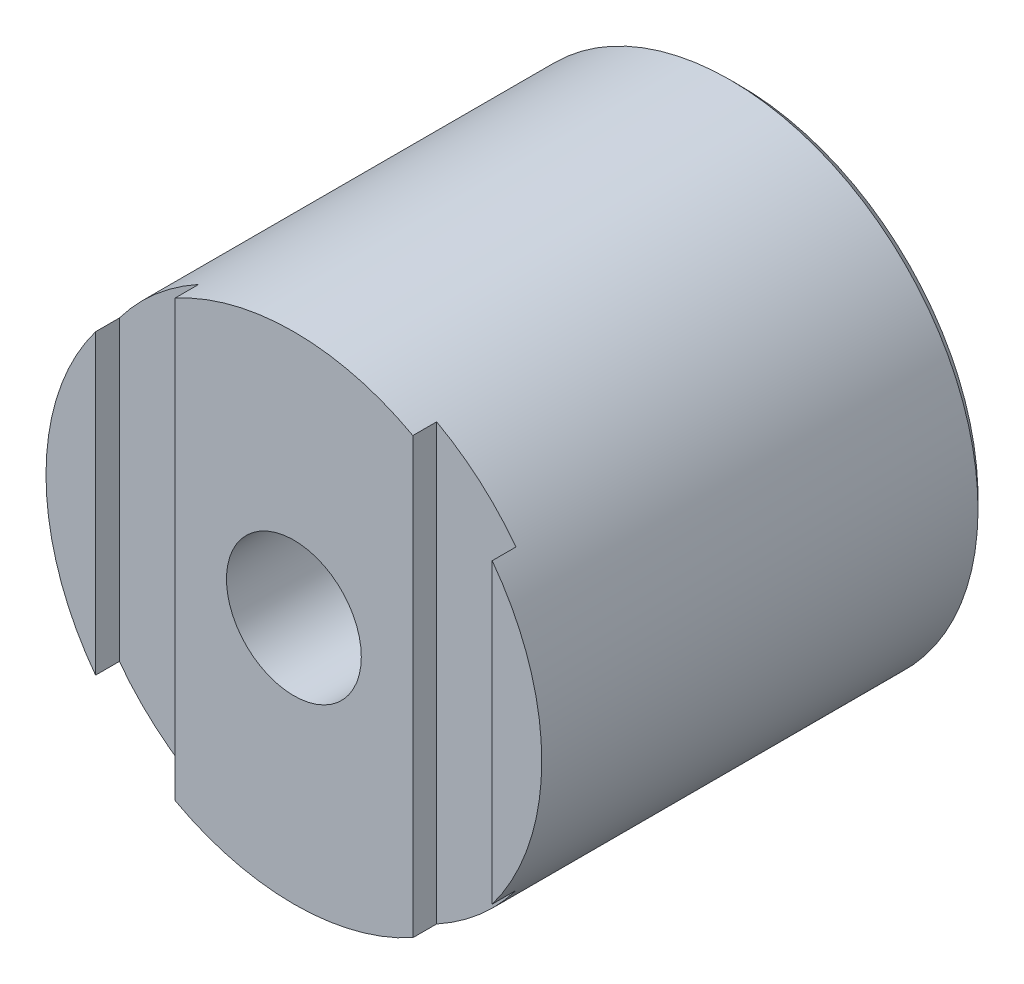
ISO-10303-21;
HEADER;
FILE_DESCRIPTION(('STEP AP214'),'2;1');
FILE_NAME('part.step','',(''),(''),'','','');
FILE_SCHEMA(('AUTOMOTIVE_DESIGN { 1 0 10303 214 1 1 1 1 }'));
ENDSEC;
DATA;
#1=APPLICATION_CONTEXT('core data for automotive mechanical design processes');
#2=APPLICATION_PROTOCOL_DEFINITION('international standard','automotive_design',2000,#1);
#3=PRODUCT_CONTEXT('',#1,'mechanical');
#4=PRODUCT('Part','Part','',(#3));
#5=PRODUCT_RELATED_PRODUCT_CATEGORY('part','',(#4));
#6=PRODUCT_DEFINITION_FORMATION('','',#4);
#7=PRODUCT_DEFINITION_CONTEXT('part definition',#1,'design');
#8=PRODUCT_DEFINITION('design','',#6,#7);
#9=PRODUCT_DEFINITION_SHAPE('','',#8);
#10=(LENGTH_UNIT() NAMED_UNIT(*) SI_UNIT(.MILLI.,.METRE.));
#11=(NAMED_UNIT(*) PLANE_ANGLE_UNIT() SI_UNIT($,.RADIAN.));
#12=(NAMED_UNIT(*) SI_UNIT($,.STERADIAN.) SOLID_ANGLE_UNIT());
#13=UNCERTAINTY_MEASURE_WITH_UNIT(LENGTH_MEASURE(1.E-05),#10,'distance_accuracy_value','');
#14=(GEOMETRIC_REPRESENTATION_CONTEXT(3) GLOBAL_UNCERTAINTY_ASSIGNED_CONTEXT((#13)) GLOBAL_UNIT_ASSIGNED_CONTEXT((#10,
#11,#12)) REPRESENTATION_CONTEXT('',''));
#15=CARTESIAN_POINT('',(0.,0.,0.));
#16=DIRECTION('',(0.,0.,1.));
#17=DIRECTION('',(1.,0.,0.));
#18=AXIS2_PLACEMENT_3D('',#15,#16,#17);
#19=CARTESIAN_POINT('',(0.,0.,0.));
#20=DIRECTION('',(0.,0.,1.));
#21=DIRECTION('',(1.,0.,0.));
#22=AXIS2_PLACEMENT_3D('',#19,#20,#21);
#23=PLANE('',#22);
#24=DIRECTION('',(0.,1.,0.));
#25=VECTOR('',#24,1.);
#26=CARTESIAN_POINT('',(10.,7.5,0.));
#27=LINE('',#26,#25);
#28=CARTESIAN_POINT('',(10.,-7.5,0.));
#29=VERTEX_POINT('',#28);
#30=CARTESIAN_POINT('',(10.,7.5,0.));
#31=VERTEX_POINT('',#30);
#32=EDGE_CURVE('E116',#29,#31,#27,.T.);
#33=ORIENTED_EDGE('',*,*,#32,.F.);
#34=CARTESIAN_POINT('',(0.,0.,0.));
#35=DIRECTION('',(0.,0.,1.));
#36=DIRECTION('',(1.,0.,0.));
#37=AXIS2_PLACEMENT_3D('',#34,#35,#36);
#38=CIRCLE('',#37,12.5);
#39=EDGE_CURVE('E123',#29,#31,#38,.T.);
#40=ORIENTED_EDGE('',*,*,#39,.T.);
#41=EDGE_LOOP('',(#33,#40));
#42=FACE_BOUND('',#41,.T.);
#43=ADVANCED_FACE('F31',(#42),#23,.T.);
#44=CARTESIAN_POINT('',(0.,0.,0.));
#45=DIRECTION('',(0.,0.,1.));
#46=DIRECTION('',(1.,0.,0.));
#47=AXIS2_PLACEMENT_3D('',#44,#45,#46);
#48=CIRCLE('',#47,3.39999999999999);
#49=CARTESIAN_POINT('',(3.39999999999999,0.,0.));
#50=VERTEX_POINT('',#49);
#51=EDGE_CURVE('E139',#50,#50,#48,.T.);
#52=ORIENTED_EDGE('',*,*,#51,.F.);
#53=EDGE_LOOP('',(#52));
#54=FACE_BOUND('',#53,.T.);
#55=DIRECTION('',(0.,-1.,0.));
#56=VECTOR('',#55,1.);
#57=CARTESIAN_POINT('',(6.,10.9658560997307,0.));
#58=LINE('',#57,#56);
#59=CARTESIAN_POINT('',(6.,10.9658560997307,0.));
#60=VERTEX_POINT('',#59);
#61=CARTESIAN_POINT('',(6.,-10.9658560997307,0.));
#62=VERTEX_POINT('',#61);
#63=EDGE_CURVE('E99',#60,#62,#58,.T.);
#64=ORIENTED_EDGE('',*,*,#63,.F.);
#65=CARTESIAN_POINT('',(-6.,10.9658560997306,0.));
#66=VERTEX_POINT('',#65);
#67=EDGE_CURVE('E112',#60,#66,#38,.T.);
#68=ORIENTED_EDGE('',*,*,#67,.T.);
#69=DIRECTION('',(0.,1.,0.));
#70=VECTOR('',#69,1.);
#71=CARTESIAN_POINT('',(-6.,10.9658560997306,0.));
#72=LINE('',#71,#70);
#73=CARTESIAN_POINT('',(-6.,-10.9658560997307,0.));
#74=VERTEX_POINT('',#73);
#75=EDGE_CURVE('E162',#74,#66,#72,.T.);
#76=ORIENTED_EDGE('',*,*,#75,.F.);
#77=EDGE_CURVE('E115',#74,#62,#38,.T.);
#78=ORIENTED_EDGE('',*,*,#77,.T.);
#79=EDGE_LOOP('',(#64,#68,#76,#78));
#80=FACE_BOUND('',#79,.T.);
#81=ADVANCED_FACE('F110',(#54,#80),#23,.T.);
#82=CARTESIAN_POINT('',(0.,0.,-22.5));
#83=DIRECTION('',(0.,0.,-1.));
#84=DIRECTION('',(-1.,0.,0.));
#85=AXIS2_PLACEMENT_3D('',#82,#83,#84);
#86=PLANE('',#85);
#87=CARTESIAN_POINT('',(0.,0.,-22.5));
#88=DIRECTION('',(0.,0.,-1.));
#89=DIRECTION('',(-1.,0.,0.));
#90=AXIS2_PLACEMENT_3D('',#87,#88,#89);
#91=CIRCLE('',#90,12.);
#92=CARTESIAN_POINT('',(-12.,0.,-22.5));
#93=VERTEX_POINT('',#92);
#94=EDGE_CURVE('E11',#93,#93,#91,.T.);
#95=ORIENTED_EDGE('',*,*,#94,.T.);
#96=EDGE_LOOP('',(#95));
#97=FACE_BOUND('',#96,.T.);
#98=CARTESIAN_POINT('',(0.,0.,-22.5));
#99=DIRECTION('',(0.,0.,1.));
#100=DIRECTION('',(1.,0.,0.));
#101=AXIS2_PLACEMENT_3D('',#98,#99,#100);
#102=CIRCLE('',#101,7.25);
#103=CARTESIAN_POINT('',(7.25,0.,-22.5));
#104=VERTEX_POINT('',#103);
#105=EDGE_CURVE('E176',#104,#104,#102,.T.);
#106=ORIENTED_EDGE('',*,*,#105,.T.);
#107=EDGE_LOOP('',(#106));
#108=FACE_BOUND('',#107,.T.);
#109=ADVANCED_FACE('F33',(#97,#108),#86,.T.);
#110=CARTESIAN_POINT('',(0.,0.,0.));
#111=DIRECTION('',(0.,0.,1.));
#112=DIRECTION('',(1.,0.,0.));
#113=AXIS2_PLACEMENT_3D('',#110,#111,#112);
#114=CYLINDRICAL_SURFACE('',#113,12.5);
#115=CARTESIAN_POINT('',(0.,0.,-22.));
#116=DIRECTION('',(0.,0.,-1.));
#117=DIRECTION('',(-1.,0.,0.));
#118=AXIS2_PLACEMENT_3D('',#115,#116,#117);
#119=CIRCLE('',#118,12.5);
#120=CARTESIAN_POINT('',(-12.5,0.,-22.));
#121=VERTEX_POINT('',#120);
#122=EDGE_CURVE('E39',#121,#121,#119,.F.);
#123=ORIENTED_EDGE('',*,*,#122,.T.);
#124=EDGE_LOOP('',(#123));
#125=FACE_BOUND('',#124,.T.);
#126=DIRECTION('',(0.,0.,1.));
#127=VECTOR('',#126,1.);
#128=CARTESIAN_POINT('',(6.,-10.9658560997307,-1.2));
#129=LINE('',#128,#127);
#130=CARTESIAN_POINT('',(6.,-10.9658560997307,-1.2));
#131=VERTEX_POINT('',#130);
#132=EDGE_CURVE('E106',#131,#62,#129,.T.);
#133=ORIENTED_EDGE('',*,*,#132,.T.);
#134=ORIENTED_EDGE('',*,*,#77,.F.);
#135=DIRECTION('',(0.,0.,1.));
#136=VECTOR('',#135,1.);
#137=CARTESIAN_POINT('',(-6.,-10.9658560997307,-1.2));
#138=LINE('',#137,#136);
#139=CARTESIAN_POINT('',(-6.,-10.9658560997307,-1.2));
#140=VERTEX_POINT('',#139);
#141=EDGE_CURVE('E177',#140,#74,#138,.T.);
#142=ORIENTED_EDGE('',*,*,#141,.F.);
#143=CARTESIAN_POINT('',(0.,0.,-1.2));
#144=DIRECTION('',(0.,0.,1.));
#145=DIRECTION('',(-1.,0.,0.));
#146=AXIS2_PLACEMENT_3D('',#143,#144,#145);
#147=CIRCLE('',#146,12.5);
#148=CARTESIAN_POINT('',(-10.,-7.49999999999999,-1.2));
#149=VERTEX_POINT('',#148);
#150=EDGE_CURVE('E170',#149,#140,#147,.T.);
#151=ORIENTED_EDGE('',*,*,#150,.F.);
#152=DIRECTION('',(0.,0.,1.));
#153=VECTOR('',#152,1.);
#154=CARTESIAN_POINT('',(-10.,-7.49999999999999,-1.2));
#155=LINE('',#154,#153);
#156=CARTESIAN_POINT('',(-10.,-7.49999999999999,0.));
#157=VERTEX_POINT('',#156);
#158=EDGE_CURVE('E179',#149,#157,#155,.T.);
#159=ORIENTED_EDGE('',*,*,#158,.T.);
#160=CARTESIAN_POINT('',(-10.,7.5,0.));
#161=VERTEX_POINT('',#160);
#162=EDGE_CURVE('E127',#161,#157,#38,.T.);
#163=ORIENTED_EDGE('',*,*,#162,.F.);
#164=DIRECTION('',(0.,0.,1.));
#165=VECTOR('',#164,1.);
#166=CARTESIAN_POINT('',(-10.,7.49999999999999,-1.2));
#167=LINE('',#166,#165);
#168=CARTESIAN_POINT('',(-10.,7.49999999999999,-1.2));
#169=VERTEX_POINT('',#168);
#170=EDGE_CURVE('E54',#169,#161,#167,.T.);
#171=ORIENTED_EDGE('',*,*,#170,.F.);
#172=CARTESIAN_POINT('',(0.,0.,-1.2));
#173=DIRECTION('',(0.,0.,1.));
#174=DIRECTION('',(-1.,0.,0.));
#175=AXIS2_PLACEMENT_3D('',#172,#173,#174);
#176=CIRCLE('',#175,12.5);
#177=CARTESIAN_POINT('',(-6.,10.9658560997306,-1.2));
#178=VERTEX_POINT('',#177);
#179=EDGE_CURVE('E164',#178,#169,#176,.T.);
#180=ORIENTED_EDGE('',*,*,#179,.F.);
#181=DIRECTION('',(0.,0.,1.));
#182=VECTOR('',#181,1.);
#183=CARTESIAN_POINT('',(-6.,10.9658560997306,-1.2));
#184=LINE('',#183,#182);
#185=EDGE_CURVE('E122',#178,#66,#184,.T.);
#186=ORIENTED_EDGE('',*,*,#185,.T.);
#187=ORIENTED_EDGE('',*,*,#67,.F.);
#188=DIRECTION('',(0.,0.,1.));
#189=VECTOR('',#188,1.);
#190=CARTESIAN_POINT('',(6.,10.9658560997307,-1.2));
#191=LINE('',#190,#189);
#192=CARTESIAN_POINT('',(6.,10.9658560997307,-1.2));
#193=VERTEX_POINT('',#192);
#194=EDGE_CURVE('E96',#193,#60,#191,.T.);
#195=ORIENTED_EDGE('',*,*,#194,.F.);
#196=CARTESIAN_POINT('',(0.,0.,-1.2));
#197=DIRECTION('',(0.,0.,1.));
#198=DIRECTION('',(1.,0.,0.));
#199=AXIS2_PLACEMENT_3D('',#196,#197,#198);
#200=CIRCLE('',#199,12.5);
#201=CARTESIAN_POINT('',(10.,7.5,-1.2));
#202=VERTEX_POINT('',#201);
#203=EDGE_CURVE('E148',#202,#193,#200,.T.);
#204=ORIENTED_EDGE('',*,*,#203,.F.);
#205=DIRECTION('',(0.,0.,1.));
#206=VECTOR('',#205,1.);
#207=CARTESIAN_POINT('',(10.,7.5,-1.2));
#208=LINE('',#207,#206);
#209=EDGE_CURVE('E154',#202,#31,#208,.T.);
#210=ORIENTED_EDGE('',*,*,#209,.T.);
#211=ORIENTED_EDGE('',*,*,#39,.F.);
#212=DIRECTION('',(0.,0.,1.));
#213=VECTOR('',#212,1.);
#214=CARTESIAN_POINT('',(10.,-7.5,-1.2));
#215=LINE('',#214,#213);
#216=CARTESIAN_POINT('',(10.,-7.5,-1.2));
#217=VERTEX_POINT('',#216);
#218=EDGE_CURVE('E158',#217,#29,#215,.T.);
#219=ORIENTED_EDGE('',*,*,#218,.F.);
#220=CARTESIAN_POINT('',(0.,0.,-1.2));
#221=DIRECTION('',(0.,0.,1.));
#222=DIRECTION('',(1.,0.,0.));
#223=AXIS2_PLACEMENT_3D('',#220,#221,#222);
#224=CIRCLE('',#223,12.5);
#225=EDGE_CURVE('E151',#131,#217,#224,.T.);
#226=ORIENTED_EDGE('',*,*,#225,.F.);
#227=EDGE_LOOP('',(#133,#134,#142,#151,#159,#163,#171,#180,#186,#187,#195,#204,#210,#211,#219,#226));
#228=FACE_BOUND('',#227,.T.);
#229=ADVANCED_FACE('F120',(#125,#228),#114,.T.);
#230=DIRECTION('',(0.,-1.,0.));
#231=VECTOR('',#230,1.);
#232=CARTESIAN_POINT('',(-10.,7.49999999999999,0.));
#233=LINE('',#232,#231);
#234=EDGE_CURVE('E157',#161,#157,#233,.T.);
#235=ORIENTED_EDGE('',*,*,#234,.F.);
#236=ORIENTED_EDGE('',*,*,#162,.T.);
#237=EDGE_LOOP('',(#235,#236));
#238=FACE_BOUND('',#237,.T.);
#239=ADVANCED_FACE('F213',(#238),#23,.T.);
#240=CARTESIAN_POINT('',(0.,0.,-16.));
#241=DIRECTION('',(0.,0.,1.));
#242=DIRECTION('',(-1.,0.,0.));
#243=AXIS2_PLACEMENT_3D('',#240,#241,#242);
#244=SPHERICAL_SURFACE('',#243,6.5);
#245=CARTESIAN_POINT('',(0.,0.,-10.4601444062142));
#246=DIRECTION('',(0.,0.,-1.));
#247=DIRECTION('',(-1.,0.,0.));
#248=AXIS2_PLACEMENT_3D('',#245,#246,#247);
#249=CIRCLE('',#248,3.39999999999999);
#250=CARTESIAN_POINT('',(-3.39999999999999,0.,-10.4601444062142));
#251=VERTEX_POINT('',#250);
#252=EDGE_CURVE('E117',#251,#251,#249,.F.);
#253=ORIENTED_EDGE('',*,*,#252,.T.);
#254=EDGE_LOOP('',(#253));
#255=FACE_BOUND('',#254,.T.);
#256=CARTESIAN_POINT('',(0.,0.,-16.));
#257=DIRECTION('',(0.,0.,1.));
#258=DIRECTION('',(1.,0.,0.));
#259=AXIS2_PLACEMENT_3D('',#256,#257,#258);
#260=CIRCLE('',#259,6.5);
#261=CARTESIAN_POINT('',(6.5,0.,-16.));
#262=VERTEX_POINT('',#261);
#263=EDGE_CURVE('E124',#262,#262,#260,.T.);
#264=ORIENTED_EDGE('',*,*,#263,.F.);
#265=EDGE_LOOP('',(#264));
#266=FACE_BOUND('',#265,.T.);
#267=ADVANCED_FACE('F208',(#255,#266),#244,.F.);
#268=CARTESIAN_POINT('',(0.,0.,0.));
#269=DIRECTION('',(0.,0.,1.));
#270=DIRECTION('',(1.,0.,0.));
#271=AXIS2_PLACEMENT_3D('',#268,#269,#270);
#272=CYLINDRICAL_SURFACE('',#271,6.5);
#273=CARTESIAN_POINT('',(0.,0.,-17.75));
#274=DIRECTION('',(0.,0.,1.));
#275=DIRECTION('',(1.,0.,0.));
#276=AXIS2_PLACEMENT_3D('',#273,#274,#275);
#277=CIRCLE('',#276,6.5);
#278=CARTESIAN_POINT('',(6.5,0.,-17.75));
#279=VERTEX_POINT('',#278);
#280=EDGE_CURVE('E129',#279,#279,#277,.T.);
#281=ORIENTED_EDGE('',*,*,#280,.F.);
#282=EDGE_LOOP('',(#281));
#283=FACE_BOUND('',#282,.T.);
#284=ORIENTED_EDGE('',*,*,#263,.T.);
#285=EDGE_LOOP('',(#284));
#286=FACE_BOUND('',#285,.T.);
#287=ADVANCED_FACE('F205',(#283,#286),#272,.F.);
#288=CARTESIAN_POINT('',(6.5,0.,-17.75));
#289=DIRECTION('',(0.,0.,1.));
#290=DIRECTION('',(1.,0.,0.));
#291=AXIS2_PLACEMENT_3D('',#288,#289,#290);
#292=PLANE('',#291);
#293=CARTESIAN_POINT('',(0.,0.,-17.75));
#294=DIRECTION('',(0.,0.,1.));
#295=DIRECTION('',(1.,0.,0.));
#296=AXIS2_PLACEMENT_3D('',#293,#294,#295);
#297=CIRCLE('',#296,8.05);
#298=CARTESIAN_POINT('',(8.05,0.,-17.75));
#299=VERTEX_POINT('',#298);
#300=EDGE_CURVE('E197',#299,#299,#297,.T.);
#301=ORIENTED_EDGE('',*,*,#300,.F.);
#302=EDGE_LOOP('',(#301));
#303=FACE_BOUND('',#302,.T.);
#304=ORIENTED_EDGE('',*,*,#280,.T.);
#305=EDGE_LOOP('',(#304));
#306=FACE_BOUND('',#305,.T.);
#307=ADVANCED_FACE('F203',(#303,#306),#292,.F.);
#308=CARTESIAN_POINT('',(0.,0.,0.));
#309=DIRECTION('',(0.,0.,1.));
#310=DIRECTION('',(1.,0.,0.));
#311=AXIS2_PLACEMENT_3D('',#308,#309,#310);
#312=CYLINDRICAL_SURFACE('',#311,8.05);
#313=CARTESIAN_POINT('',(0.,0.,-19.3));
#314=DIRECTION('',(0.,0.,1.));
#315=DIRECTION('',(1.,0.,0.));
#316=AXIS2_PLACEMENT_3D('',#313,#314,#315);
#317=CIRCLE('',#316,8.05);
#318=CARTESIAN_POINT('',(8.05,0.,-19.3));
#319=VERTEX_POINT('',#318);
#320=EDGE_CURVE('E194',#319,#319,#317,.T.);
#321=ORIENTED_EDGE('',*,*,#320,.F.);
#322=EDGE_LOOP('',(#321));
#323=FACE_BOUND('',#322,.T.);
#324=ORIENTED_EDGE('',*,*,#300,.T.);
#325=EDGE_LOOP('',(#324));
#326=FACE_BOUND('',#325,.T.);
#327=ADVANCED_FACE('F259',(#323,#326),#312,.F.);
#328=CARTESIAN_POINT('',(8.05,0.,-19.3));
#329=DIRECTION('',(0.,0.,-1.));
#330=DIRECTION('',(-1.,0.,0.));
#331=AXIS2_PLACEMENT_3D('',#328,#329,#330);
#332=PLANE('',#331);
#333=CARTESIAN_POINT('',(0.,0.,-19.3));
#334=DIRECTION('',(0.,0.,1.));
#335=DIRECTION('',(1.,0.,0.));
#336=AXIS2_PLACEMENT_3D('',#333,#334,#335);
#337=CIRCLE('',#336,6.5);
#338=CARTESIAN_POINT('',(6.5,0.,-19.3));
#339=VERTEX_POINT('',#338);
#340=EDGE_CURVE('E191',#339,#339,#337,.T.);
#341=ORIENTED_EDGE('',*,*,#340,.F.);
#342=EDGE_LOOP('',(#341));
#343=FACE_BOUND('',#342,.T.);
#344=ORIENTED_EDGE('',*,*,#320,.T.);
#345=EDGE_LOOP('',(#344));
#346=FACE_BOUND('',#345,.T.);
#347=ADVANCED_FACE('F253',(#343,#346),#332,.F.);
#348=CARTESIAN_POINT('',(0.,0.,0.));
#349=DIRECTION('',(0.,0.,1.));
#350=DIRECTION('',(1.,0.,0.));
#351=AXIS2_PLACEMENT_3D('',#348,#349,#350);
#352=CYLINDRICAL_SURFACE('',#351,6.5);
#353=CARTESIAN_POINT('',(0.,0.,-20.5));
#354=DIRECTION('',(0.,0.,1.));
#355=DIRECTION('',(1.,0.,0.));
#356=AXIS2_PLACEMENT_3D('',#353,#354,#355);
#357=CIRCLE('',#356,6.5);
#358=CARTESIAN_POINT('',(6.5,0.,-20.5));
#359=VERTEX_POINT('',#358);
#360=EDGE_CURVE('E188',#359,#359,#357,.T.);
#361=ORIENTED_EDGE('',*,*,#360,.F.);
#362=EDGE_LOOP('',(#361));
#363=FACE_BOUND('',#362,.T.);
#364=ORIENTED_EDGE('',*,*,#340,.T.);
#365=EDGE_LOOP('',(#364));
#366=FACE_BOUND('',#365,.T.);
#367=ADVANCED_FACE('F247',(#363,#366),#352,.F.);
#368=CARTESIAN_POINT('',(0.,0.,-20.5));
#369=DIRECTION('',(0.,0.,-1.));
#370=DIRECTION('',(-1.,0.,0.));
#371=AXIS2_PLACEMENT_3D('',#368,#369,#370);
#372=CONICAL_SURFACE('',#371,6.5,0.523598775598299);
#373=CARTESIAN_POINT('',(0.,0.,-21.7990381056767));
#374=DIRECTION('',(0.,0.,1.));
#375=DIRECTION('',(1.,0.,0.));
#376=AXIS2_PLACEMENT_3D('',#373,#374,#375);
#377=CIRCLE('',#376,7.25);
#378=CARTESIAN_POINT('',(7.25,0.,-21.7990381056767));
#379=VERTEX_POINT('',#378);
#380=EDGE_CURVE('E185',#379,#379,#377,.T.);
#381=ORIENTED_EDGE('',*,*,#380,.F.);
#382=EDGE_LOOP('',(#381));
#383=FACE_BOUND('',#382,.T.);
#384=ORIENTED_EDGE('',*,*,#360,.T.);
#385=EDGE_LOOP('',(#384));
#386=FACE_BOUND('',#385,.T.);
#387=ADVANCED_FACE('F241',(#383,#386),#372,.F.);
#388=CARTESIAN_POINT('',(0.,0.,0.));
#389=DIRECTION('',(0.,0.,1.));
#390=DIRECTION('',(1.,0.,0.));
#391=AXIS2_PLACEMENT_3D('',#388,#389,#390);
#392=CYLINDRICAL_SURFACE('',#391,7.25);
#393=ORIENTED_EDGE('',*,*,#105,.F.);
#394=EDGE_LOOP('',(#393));
#395=FACE_BOUND('',#394,.T.);
#396=ORIENTED_EDGE('',*,*,#380,.T.);
#397=EDGE_LOOP('',(#396));
#398=FACE_BOUND('',#397,.T.);
#399=ADVANCED_FACE('F237',(#395,#398),#392,.F.);
#400=CARTESIAN_POINT('',(-6.,10.9658560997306,-1.2));
#401=DIRECTION('',(1.,0.,0.));
#402=DIRECTION('',(0.,0.,-1.));
#403=AXIS2_PLACEMENT_3D('',#400,#401,#402);
#404=PLANE('',#403);
#405=ORIENTED_EDGE('',*,*,#75,.T.);
#406=ORIENTED_EDGE('',*,*,#185,.F.);
#407=DIRECTION('',(0.,1.,0.));
#408=VECTOR('',#407,1.);
#409=CARTESIAN_POINT('',(-6.,10.9658560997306,-1.2));
#410=LINE('',#409,#408);
#411=EDGE_CURVE('E172',#140,#178,#410,.T.);
#412=ORIENTED_EDGE('',*,*,#411,.F.);
#413=ORIENTED_EDGE('',*,*,#141,.T.);
#414=EDGE_LOOP('',(#405,#406,#412,#413));
#415=FACE_BOUND('',#414,.T.);
#416=ADVANCED_FACE('F240',(#415),#404,.F.);
#417=CARTESIAN_POINT('',(-10.,7.49999999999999,-1.2));
#418=DIRECTION('',(-1.,0.,0.));
#419=DIRECTION('',(0.,0.,1.));
#420=AXIS2_PLACEMENT_3D('',#417,#418,#419);
#421=PLANE('',#420);
#422=ORIENTED_EDGE('',*,*,#234,.T.);
#423=ORIENTED_EDGE('',*,*,#158,.F.);
#424=DIRECTION('',(0.,-1.,0.));
#425=VECTOR('',#424,1.);
#426=CARTESIAN_POINT('',(-10.,7.49999999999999,-1.2));
#427=LINE('',#426,#425);
#428=EDGE_CURVE('E167',#169,#149,#427,.T.);
#429=ORIENTED_EDGE('',*,*,#428,.F.);
#430=ORIENTED_EDGE('',*,*,#170,.T.);
#431=EDGE_LOOP('',(#422,#423,#429,#430));
#432=FACE_BOUND('',#431,.T.);
#433=ADVANCED_FACE('F273',(#432),#421,.F.);
#434=CARTESIAN_POINT('',(0.,0.,-1.2));
#435=DIRECTION('',(0.,0.,-1.));
#436=DIRECTION('',(-1.,0.,0.));
#437=AXIS2_PLACEMENT_3D('',#434,#435,#436);
#438=PLANE('',#437);
#439=ORIENTED_EDGE('',*,*,#179,.T.);
#440=ORIENTED_EDGE('',*,*,#428,.T.);
#441=ORIENTED_EDGE('',*,*,#150,.T.);
#442=ORIENTED_EDGE('',*,*,#411,.T.);
#443=EDGE_LOOP('',(#439,#440,#441,#442));
#444=FACE_BOUND('',#443,.T.);
#445=ADVANCED_FACE('F276',(#444),#438,.F.);
#446=CARTESIAN_POINT('',(10.,7.5,-1.2));
#447=DIRECTION('',(1.,0.,0.));
#448=DIRECTION('',(0.,0.,-1.));
#449=AXIS2_PLACEMENT_3D('',#446,#447,#448);
#450=PLANE('',#449);
#451=ORIENTED_EDGE('',*,*,#32,.T.);
#452=ORIENTED_EDGE('',*,*,#209,.F.);
#453=DIRECTION('',(0.,1.,0.));
#454=VECTOR('',#453,1.);
#455=CARTESIAN_POINT('',(10.,7.5,-1.2));
#456=LINE('',#455,#454);
#457=EDGE_CURVE('E46',#217,#202,#456,.T.);
#458=ORIENTED_EDGE('',*,*,#457,.F.);
#459=ORIENTED_EDGE('',*,*,#218,.T.);
#460=EDGE_LOOP('',(#451,#452,#458,#459));
#461=FACE_BOUND('',#460,.T.);
#462=ADVANCED_FACE('F282',(#461),#450,.F.);
#463=CARTESIAN_POINT('',(6.,10.9658560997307,-1.2));
#464=DIRECTION('',(-1.,0.,0.));
#465=DIRECTION('',(0.,0.,1.));
#466=AXIS2_PLACEMENT_3D('',#463,#464,#465);
#467=PLANE('',#466);
#468=ORIENTED_EDGE('',*,*,#63,.T.);
#469=ORIENTED_EDGE('',*,*,#132,.F.);
#470=DIRECTION('',(0.,-1.,0.));
#471=VECTOR('',#470,1.);
#472=CARTESIAN_POINT('',(6.,10.9658560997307,-1.2));
#473=LINE('',#472,#471);
#474=EDGE_CURVE('E102',#193,#131,#473,.T.);
#475=ORIENTED_EDGE('',*,*,#474,.F.);
#476=ORIENTED_EDGE('',*,*,#194,.T.);
#477=EDGE_LOOP('',(#468,#469,#475,#476));
#478=FACE_BOUND('',#477,.T.);
#479=ADVANCED_FACE('F98',(#478),#467,.F.);
#480=CARTESIAN_POINT('',(0.,0.,-1.2));
#481=DIRECTION('',(0.,0.,1.));
#482=DIRECTION('',(1.,0.,0.));
#483=AXIS2_PLACEMENT_3D('',#480,#481,#482);
#484=PLANE('',#483);
#485=ORIENTED_EDGE('',*,*,#203,.T.);
#486=ORIENTED_EDGE('',*,*,#474,.T.);
#487=ORIENTED_EDGE('',*,*,#225,.T.);
#488=ORIENTED_EDGE('',*,*,#457,.T.);
#489=EDGE_LOOP('',(#485,#486,#487,#488));
#490=FACE_BOUND('',#489,.T.);
#491=ADVANCED_FACE('F286',(#490),#484,.T.);
#492=CARTESIAN_POINT('',(0.,0.,0.));
#493=DIRECTION('',(0.,0.,1.));
#494=DIRECTION('',(1.,0.,0.));
#495=AXIS2_PLACEMENT_3D('',#492,#493,#494);
#496=CYLINDRICAL_SURFACE('',#495,3.39999999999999);
#497=ORIENTED_EDGE('',*,*,#51,.T.);
#498=EDGE_LOOP('',(#497));
#499=FACE_BOUND('',#498,.T.);
#500=ORIENTED_EDGE('',*,*,#252,.F.);
#501=EDGE_LOOP('',(#500));
#502=FACE_BOUND('',#501,.T.);
#503=ADVANCED_FACE('F292',(#499,#502),#496,.F.);
#504=CARTESIAN_POINT('',(0.,0.,-22.));
#505=DIRECTION('',(0.,0.,1.));
#506=DIRECTION('',(1.,0.,0.));
#507=AXIS2_PLACEMENT_3D('',#504,#505,#506);
#508=CONICAL_SURFACE('',#507,12.5,0.785398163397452);
#509=ORIENTED_EDGE('',*,*,#94,.F.);
#510=EDGE_LOOP('',(#509));
#511=FACE_BOUND('',#510,.T.);
#512=ORIENTED_EDGE('',*,*,#122,.F.);
#513=EDGE_LOOP('',(#512));
#514=FACE_BOUND('',#513,.T.);
#515=ADVANCED_FACE('F295',(#511,#514),#508,.T.);
#516=CLOSED_SHELL('',(#43,#81,#109,#229,#239,#267,#287,#307,#327,#347,#367,#387,#399,#416,#433,
#445,#462,#479,#491,#503,#515));
#517=MANIFOLD_SOLID_BREP('B2',#516);
#518=ADVANCED_BREP_SHAPE_REPRESENTATION('',(#18,#517),#14);
#519=SHAPE_DEFINITION_REPRESENTATION(#9,#518);
ENDSEC;
END-ISO-10303-21;
